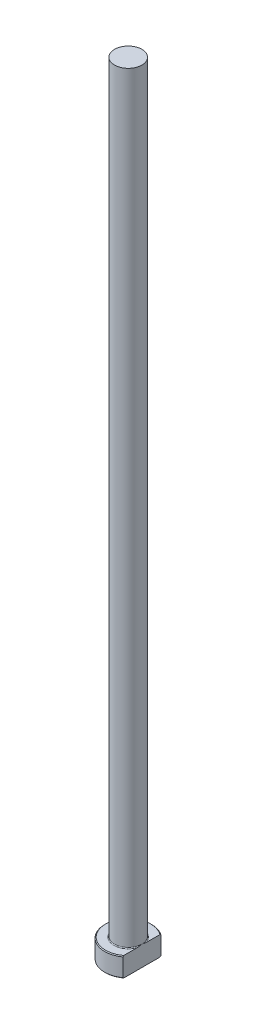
ISO-10303-21;
HEADER;
FILE_DESCRIPTION(('STEP AP214'),'2;1');
FILE_NAME('part.step','',(''),(''),'','','');
FILE_SCHEMA(('AUTOMOTIVE_DESIGN { 1 0 10303 214 1 1 1 1 }'));
ENDSEC;
DATA;
#1=APPLICATION_CONTEXT('core data for automotive mechanical design processes');
#2=APPLICATION_PROTOCOL_DEFINITION('international standard','automotive_design',2000,#1);
#3=PRODUCT_CONTEXT('',#1,'mechanical');
#4=PRODUCT('Part','Part','',(#3));
#5=PRODUCT_RELATED_PRODUCT_CATEGORY('part','',(#4));
#6=PRODUCT_DEFINITION_FORMATION('','',#4);
#7=PRODUCT_DEFINITION_CONTEXT('part definition',#1,'design');
#8=PRODUCT_DEFINITION('design','',#6,#7);
#9=PRODUCT_DEFINITION_SHAPE('','',#8);
#10=(LENGTH_UNIT() NAMED_UNIT(*) SI_UNIT(.MILLI.,.METRE.));
#11=(NAMED_UNIT(*) PLANE_ANGLE_UNIT() SI_UNIT($,.RADIAN.));
#12=(NAMED_UNIT(*) SI_UNIT($,.STERADIAN.) SOLID_ANGLE_UNIT());
#13=UNCERTAINTY_MEASURE_WITH_UNIT(LENGTH_MEASURE(1.E-05),#10,'distance_accuracy_value','');
#14=(GEOMETRIC_REPRESENTATION_CONTEXT(3) GLOBAL_UNCERTAINTY_ASSIGNED_CONTEXT((#13)) GLOBAL_UNIT_ASSIGNED_CONTEXT((#10,
#11,#12)) REPRESENTATION_CONTEXT('',''));
#15=CARTESIAN_POINT('',(0.,0.,0.));
#16=DIRECTION('',(0.,0.,1.));
#17=DIRECTION('',(1.,0.,0.));
#18=AXIS2_PLACEMENT_3D('',#15,#16,#17);
#19=CARTESIAN_POINT('',(0.,0.,0.));
#20=DIRECTION('',(0.,-1.,0.));
#21=DIRECTION('',(0.,0.,-1.));
#22=AXIS2_PLACEMENT_3D('',#19,#20,#21);
#23=PLANE('',#22);
#24=CARTESIAN_POINT('',(0.,0.,0.));
#25=DIRECTION('',(0.,-1.,0.));
#26=DIRECTION('',(0.,0.,-1.));
#27=AXIS2_PLACEMENT_3D('',#24,#25,#26);
#28=CIRCLE('',#27,5.79999999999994);
#29=CARTESIAN_POINT('',(3.49999999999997,0.,4.62493243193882));
#30=VERTEX_POINT('',#29);
#31=CARTESIAN_POINT('',(3.49999999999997,0.,-4.62493243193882));
#32=VERTEX_POINT('',#31);
#33=EDGE_CURVE('E98',#30,#32,#28,.T.);
#34=ORIENTED_EDGE('',*,*,#33,.T.);
#35=DIRECTION('',(0.,0.,1.));
#36=VECTOR('',#35,1.);
#37=CARTESIAN_POINT('',(3.49999999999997,0.,-4.87339717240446));
#38=LINE('',#37,#36);
#39=EDGE_CURVE('E83',#32,#30,#38,.T.);
#40=ORIENTED_EDGE('',*,*,#39,.T.);
#41=EDGE_LOOP('',(#34,#40));
#42=FACE_BOUND('',#41,.T.);
#43=ADVANCED_FACE('F32',(#42),#23,.T.);
#44=CARTESIAN_POINT('',(0.,259.958771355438,0.));
#45=DIRECTION('',(0.,1.,0.));
#46=DIRECTION('',(0.,0.,1.));
#47=AXIS2_PLACEMENT_3D('',#44,#45,#46);
#48=CYLINDRICAL_SURFACE('',#47,5.99999999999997);
#49=CARTESIAN_POINT('',(0.,4.80000000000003,0.));
#50=DIRECTION('',(0.,1.,0.));
#51=DIRECTION('',(0.,0.,1.));
#52=AXIS2_PLACEMENT_3D('',#49,#50,#51);
#53=CIRCLE('',#52,5.99999999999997);
#54=CARTESIAN_POINT('',(3.49999999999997,4.80000000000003,4.87339717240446));
#55=VERTEX_POINT('',#54);
#56=CARTESIAN_POINT('',(3.49999999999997,4.80000000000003,-4.87339717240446));
#57=VERTEX_POINT('',#56);
#58=EDGE_CURVE('E104',#55,#57,#53,.F.);
#59=ORIENTED_EDGE('',*,*,#58,.T.);
#60=DIRECTION('',(0.,-1.,0.));
#61=VECTOR('',#60,1.);
#62=CARTESIAN_POINT('',(3.49999999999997,200.,-4.87339717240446));
#63=LINE('',#62,#61);
#64=CARTESIAN_POINT('',(3.49999999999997,0.200000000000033,-4.87339717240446));
#65=VERTEX_POINT('',#64);
#66=EDGE_CURVE('E183',#57,#65,#63,.T.);
#67=ORIENTED_EDGE('',*,*,#66,.T.);
#68=CARTESIAN_POINT('',(0.,0.200000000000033,0.));
#69=DIRECTION('',(0.,-1.,0.));
#70=DIRECTION('',(0.,0.,-1.));
#71=AXIS2_PLACEMENT_3D('',#68,#69,#70);
#72=CIRCLE('',#71,5.99999999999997);
#73=CARTESIAN_POINT('',(3.49999999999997,0.200000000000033,4.87339717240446));
#74=VERTEX_POINT('',#73);
#75=EDGE_CURVE('E100',#65,#74,#72,.F.);
#76=ORIENTED_EDGE('',*,*,#75,.T.);
#77=DIRECTION('',(0.,-1.,0.));
#78=VECTOR('',#77,1.);
#79=CARTESIAN_POINT('',(3.49999999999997,200.,4.87339717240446));
#80=LINE('',#79,#78);
#81=EDGE_CURVE('E93',#55,#74,#80,.T.);
#82=ORIENTED_EDGE('',*,*,#81,.F.);
#83=EDGE_LOOP('',(#59,#67,#76,#82));
#84=FACE_BOUND('',#83,.T.);
#85=ADVANCED_FACE('F158',(#84),#48,.T.);
#86=CARTESIAN_POINT('',(-5.99999999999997,5.,0.));
#87=DIRECTION('',(0.,1.,0.));
#88=DIRECTION('',(0.,0.,1.));
#89=AXIS2_PLACEMENT_3D('',#86,#87,#88);
#90=PLANE('',#89);
#91=CARTESIAN_POINT('',(0.,5.,0.));
#92=DIRECTION('',(0.,1.,0.));
#93=DIRECTION('',(0.,0.,1.));
#94=AXIS2_PLACEMENT_3D('',#91,#92,#93);
#95=CIRCLE('',#94,5.79999999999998);
#96=CARTESIAN_POINT('',(3.49999999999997,5.,-4.62493243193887));
#97=VERTEX_POINT('',#96);
#98=CARTESIAN_POINT('',(3.49999999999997,5.,4.62493243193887));
#99=VERTEX_POINT('',#98);
#100=EDGE_CURVE('E178',#97,#99,#95,.T.);
#101=ORIENTED_EDGE('',*,*,#100,.T.);
#102=DIRECTION('',(0.,0.,-1.));
#103=VECTOR('',#102,1.);
#104=CARTESIAN_POINT('',(3.49999999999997,5.,0.));
#105=LINE('',#104,#103);
#106=CARTESIAN_POINT('',(3.49999999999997,4.99999999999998,1.19999999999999));
#107=VERTEX_POINT('',#106);
#108=EDGE_CURVE('E57',#99,#107,#105,.T.);
#109=ORIENTED_EDGE('',*,*,#108,.T.);
#110=CARTESIAN_POINT('',(0.,5.,0.));
#111=DIRECTION('',(0.,1.,0.));
#112=DIRECTION('',(0.,0.,1.));
#113=AXIS2_PLACEMENT_3D('',#110,#111,#112);
#114=CIRCLE('',#113,3.69999999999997);
#115=CARTESIAN_POINT('',(3.49999999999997,4.99999999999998,-1.19999999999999));
#116=VERTEX_POINT('',#115);
#117=EDGE_CURVE('E107',#107,#116,#114,.F.);
#118=ORIENTED_EDGE('',*,*,#117,.T.);
#119=EDGE_CURVE('E136',#116,#97,#105,.T.);
#120=ORIENTED_EDGE('',*,*,#119,.T.);
#121=EDGE_LOOP('',(#101,#109,#118,#120));
#122=FACE_BOUND('',#121,.T.);
#123=ADVANCED_FACE('F147',(#122),#90,.T.);
#124=CARTESIAN_POINT('',(0.,5.,0.));
#125=DIRECTION('',(0.,-1.,0.));
#126=DIRECTION('',(0.,0.,-1.));
#127=AXIS2_PLACEMENT_3D('',#124,#125,#126);
#128=CONICAL_SURFACE('',#127,5.79999999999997,0.785398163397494);
#129=ORIENTED_EDGE('',*,*,#58,.F.);
#130=CARTESIAN_POINT('',(3.49999999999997,-0.479658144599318,10.7229048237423));
#131=CARTESIAN_POINT('',(3.49999999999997,-0.304627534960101,10.5387821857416));
#132=CARTESIAN_POINT('',(3.49999999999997,-0.12982047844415,10.3544468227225));
#133=CARTESIAN_POINT('',(3.49999999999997,0.219261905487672,9.98527122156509));
#134=CARTESIAN_POINT('',(3.49999999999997,0.39353722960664,9.80043098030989));
#135=CARTESIAN_POINT('',(3.49999999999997,0.91559488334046,9.24486752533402));
#136=CARTESIAN_POINT('',(3.49999999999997,1.26244829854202,8.87327020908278));
#137=CARTESIAN_POINT('',(3.49999999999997,1.95718621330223,8.12195979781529));
#138=CARTESIAN_POINT('',(3.49999999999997,2.30502483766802,7.74220412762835));
#139=CARTESIAN_POINT('',(3.49999999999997,2.82267860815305,7.16898192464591));
#140=CARTESIAN_POINT('',(3.49999999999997,2.99451670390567,6.97734293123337));
#141=CARTESIAN_POINT('',(3.49999999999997,3.33649221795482,6.59255347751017));
#142=CARTESIAN_POINT('',(3.49999999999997,3.50662964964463,6.39940302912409));
#143=CARTESIAN_POINT('',(3.49999999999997,3.80984794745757,6.05127590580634));
#144=CARTESIAN_POINT('',(3.49999999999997,3.9433293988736,5.89664839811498));
#145=CARTESIAN_POINT('',(3.49999999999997,4.20861192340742,5.58595941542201));
#146=CARTESIAN_POINT('',(3.49999999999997,4.34041301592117,5.42989795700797));
#147=CARTESIAN_POINT('',(3.49999999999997,4.60204886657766,5.11587234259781));
#148=CARTESIAN_POINT('',(3.49999999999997,4.73188156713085,4.9579064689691));
#149=CARTESIAN_POINT('',(3.49999999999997,4.98887681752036,4.63982145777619));
#150=CARTESIAN_POINT('',(3.49999999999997,5.11603946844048,4.47970240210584));
#151=CARTESIAN_POINT('',(3.49999999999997,5.36664013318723,4.15712646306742));
#152=CARTESIAN_POINT('',(3.49999999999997,5.49008567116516,3.99467544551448));
#153=CARTESIAN_POINT('',(3.49999999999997,5.73245687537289,3.6663703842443));
#154=CARTESIAN_POINT('',(3.49999999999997,5.85138169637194,3.50051571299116));
#155=CARTESIAN_POINT('',(3.49999999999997,6.08288587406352,3.16479623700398));
#156=CARTESIAN_POINT('',(3.49999999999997,6.19547497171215,2.99493819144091));
#157=CARTESIAN_POINT('',(3.49999999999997,6.41208556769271,2.6498795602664));
#158=CARTESIAN_POINT('',(3.49999999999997,6.51611116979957,2.47468158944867));
#159=CARTESIAN_POINT('',(3.49999999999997,6.68667355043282,2.16371702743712));
#160=CARTESIAN_POINT('',(3.49999999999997,6.75595020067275,2.02946380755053));
#161=CARTESIAN_POINT('',(3.49999999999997,6.88572771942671,1.75668071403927));
#162=CARTESIAN_POINT('',(3.49999999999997,6.9462264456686,1.61814980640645));
#163=CARTESIAN_POINT('',(3.49999999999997,7.05535730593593,1.33751093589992));
#164=CARTESIAN_POINT('',(3.49999999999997,7.10406788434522,1.1954339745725));
#165=CARTESIAN_POINT('',(3.49999999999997,7.18698872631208,0.907101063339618));
#166=CARTESIAN_POINT('',(3.49999999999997,7.22121012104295,0.760848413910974));
#167=CARTESIAN_POINT('',(3.49999999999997,7.26487302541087,0.507831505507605));
#168=CARTESIAN_POINT('',(3.49999999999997,7.27861043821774,0.401805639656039));
#169=CARTESIAN_POINT('',(3.49999999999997,7.29650595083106,0.188947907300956));
#170=CARTESIAN_POINT('',(3.49999999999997,7.30066582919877,0.0821161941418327));
#171=CARTESIAN_POINT('',(3.49999999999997,7.29916002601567,-0.131492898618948));
#172=CARTESIAN_POINT('',(3.49999999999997,7.29349282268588,-0.238270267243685));
#173=CARTESIAN_POINT('',(3.49999999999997,7.27266406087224,-0.450895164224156));
#174=CARTESIAN_POINT('',(3.49999999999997,7.25750065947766,-0.556742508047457));
#175=CARTESIAN_POINT('',(3.49999999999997,7.21256554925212,-0.79858965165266));
#176=CARTESIAN_POINT('',(3.49999999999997,7.17976248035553,-0.934025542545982));
#177=CARTESIAN_POINT('',(3.49999999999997,7.10180151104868,-1.20127435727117));
#178=CARTESIAN_POINT('',(3.49999999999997,7.05663717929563,-1.33308535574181));
#179=CARTESIAN_POINT('',(3.49999999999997,6.95617548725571,-1.59358719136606));
#180=CARTESIAN_POINT('',(3.49999999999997,6.90082290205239,-1.72225647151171));
#181=CARTESIAN_POINT('',(3.49999999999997,6.81196782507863,-1.91246868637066));
#182=CARTESIAN_POINT('',(3.49999999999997,6.78138093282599,-1.97540288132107));
#183=CARTESIAN_POINT('',(3.49999999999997,6.71848328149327,-2.10040375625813));
#184=CARTESIAN_POINT('',(3.49999999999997,6.68617255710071,-2.16247045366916));
#185=CARTESIAN_POINT('',(3.49999999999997,6.59348343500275,-2.33529342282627));
#186=CARTESIAN_POINT('',(3.49999999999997,6.53139715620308,-2.44513435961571));
#187=CARTESIAN_POINT('',(3.49999999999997,6.40327495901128,-2.66249790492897));
#188=CARTESIAN_POINT('',(3.49999999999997,6.33723828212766,-2.77002006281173));
#189=CARTESIAN_POINT('',(3.49999999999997,6.20193961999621,-2.98310926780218));
#190=CARTESIAN_POINT('',(3.49999999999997,6.13267551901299,-3.08867496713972));
#191=CARTESIAN_POINT('',(3.49999999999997,5.99154722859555,-3.29805772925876));
#192=CARTESIAN_POINT('',(3.49999999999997,5.91968285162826,-3.40187466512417));
#193=CARTESIAN_POINT('',(3.49999999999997,5.70053198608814,-3.71160333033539));
#194=CARTESIAN_POINT('',(3.49999999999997,5.55004115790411,-3.91524708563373));
#195=CARTESIAN_POINT('',(3.49999999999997,5.24323373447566,-4.31793623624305));
#196=CARTESIAN_POINT('',(3.49999999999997,5.08691924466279,-4.5169832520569));
#197=CARTESIAN_POINT('',(3.49999999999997,4.76917008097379,-4.91272714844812));
#198=CARTESIAN_POINT('',(3.49999999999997,4.60771212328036,-5.10940527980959));
#199=CARTESIAN_POINT('',(3.49999999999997,4.28159454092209,-5.50010578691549));
#200=CARTESIAN_POINT('',(3.49999999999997,4.11693466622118,-5.69412795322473));
#201=CARTESIAN_POINT('',(3.49999999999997,3.7854437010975,-6.07977702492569));
#202=CARTESIAN_POINT('',(3.49999999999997,3.61861641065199,-6.27140720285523));
#203=CARTESIAN_POINT('',(3.49999999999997,3.28306967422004,-6.65300504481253));
#204=CARTESIAN_POINT('',(3.49999999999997,3.11435020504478,-6.84297268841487));
#205=CARTESIAN_POINT('',(3.49999999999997,2.66324311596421,-7.3468737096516));
#206=CARTESIAN_POINT('',(3.49999999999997,2.37954008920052,-7.65962881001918));
#207=CARTESIAN_POINT('',(3.49999999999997,1.80910784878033,-8.28261634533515));
#208=CARTESIAN_POINT('',(3.49999999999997,1.52237733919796,-8.59284759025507));
#209=CARTESIAN_POINT('',(3.49999999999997,0.950562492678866,-9.20727688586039));
#210=CARTESIAN_POINT('',(3.49999999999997,0.665505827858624,-9.51150072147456));
#211=CARTESIAN_POINT('',(3.49999999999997,0.0939335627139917,-10.1182972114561));
#212=CARTESIAN_POINT('',(3.49999999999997,-0.192581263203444,-10.4208705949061));
#213=CARTESIAN_POINT('',(3.49999999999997,-0.479658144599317,-10.7229048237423));
#214=B_SPLINE_CURVE_WITH_KNOTS('',3,(#130,#131,#132,#133,#134,#135,#136,#137,#138,#139,#140,
#141,#142,#143,#144,#145,#146,#147,#148,#149,#150,#151,#152,#153,#154,#155,#156,#157,#158,#159,
#160,#161,#162,#163,#164,#165,#166,#167,#168,#169,#170,#171,#172,#173,#174,#175,#176,#177,#178,
#179,#180,#181,#182,#183,#184,#185,#186,#187,#188,#189,#190,#191,#192,#193,#194,#195,#196,#197,
#198,#199,#200,#201,#202,#203,#204,#205,#206,#207,#208,#209,#210,#211,#212,#213),.UNSPECIFIED.,
.F.,.F.,(4,2,2,2,2,2,2,2,2,2,2,2,2,2,2,2,2,2,2,2,2,2,2,2,2,2,2,2,2,2,2,2,2,2,2,2,2,2,2,2,2,4),
(0.,0.762123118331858,1.52425095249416,3.04920520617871,4.59410962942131,5.36629689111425,
6.13847806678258,6.75128402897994,7.36408291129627,7.97748343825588,8.59086070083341,
9.20289910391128,9.81505138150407,10.4262352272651,11.0371244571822,11.4901076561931,
11.94320122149,12.393191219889,12.842834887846,13.1631796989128,13.4834650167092,
13.8037999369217,14.1241970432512,14.5415079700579,14.9590364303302,15.3788985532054,
15.5887982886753,15.7986938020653,16.1771020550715,16.5555831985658,16.9343160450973,
17.3130762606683,18.0725457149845,18.8317432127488,19.5950831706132,20.3584829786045,
21.1206884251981,21.88290322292,23.1496528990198,24.4169687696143,25.6676760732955,
26.9177769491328),.UNSPECIFIED.);
#215=EDGE_CURVE('E135',#55,#99,#214,.T.);
#216=ORIENTED_EDGE('',*,*,#215,.T.);
#217=ORIENTED_EDGE('',*,*,#100,.F.);
#218=EDGE_CURVE('E127',#97,#57,#214,.T.);
#219=ORIENTED_EDGE('',*,*,#218,.T.);
#220=EDGE_LOOP('',(#129,#216,#217,#219));
#221=FACE_BOUND('',#220,.T.);
#222=ADVANCED_FACE('F143',(#221),#128,.T.);
#223=CARTESIAN_POINT('',(0.,0.200000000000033,0.));
#224=DIRECTION('',(0.,1.,0.));
#225=DIRECTION('',(0.,0.,1.));
#226=AXIS2_PLACEMENT_3D('',#223,#224,#225);
#227=CONICAL_SURFACE('',#226,5.99999999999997,0.785398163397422);
#228=ORIENTED_EDGE('',*,*,#75,.F.);
#229=CARTESIAN_POINT('',(3.49999999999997,5.47965814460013,-10.7229048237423));
#230=CARTESIAN_POINT('',(3.49999999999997,5.3046275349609,-10.5387821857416));
#231=CARTESIAN_POINT('',(3.49999999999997,5.12982047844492,-10.3544468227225));
#232=CARTESIAN_POINT('',(3.49999999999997,4.78073809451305,-9.9852712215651));
#233=CARTESIAN_POINT('',(3.49999999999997,4.60646277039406,-9.80043098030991));
#234=CARTESIAN_POINT('',(3.49999999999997,4.08440511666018,-9.24486752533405));
#235=CARTESIAN_POINT('',(3.49999999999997,3.73755170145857,-8.87327020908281));
#236=CARTESIAN_POINT('',(3.49999999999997,3.04281378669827,-8.12195979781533));
#237=CARTESIAN_POINT('',(3.49999999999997,2.69497516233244,-7.74220412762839));
#238=CARTESIAN_POINT('',(3.49999999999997,2.17732139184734,-7.16898192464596));
#239=CARTESIAN_POINT('',(3.49999999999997,2.0054832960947,-6.97734293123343));
#240=CARTESIAN_POINT('',(3.49999999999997,1.66350778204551,-6.59255347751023));
#241=CARTESIAN_POINT('',(3.49999999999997,1.49337035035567,-6.39940302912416));
#242=CARTESIAN_POINT('',(3.49999999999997,1.1901520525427,-6.05127590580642));
#243=CARTESIAN_POINT('',(3.49999999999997,1.05667060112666,-5.89664839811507));
#244=CARTESIAN_POINT('',(3.49999999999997,0.791388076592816,-5.58595941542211));
#245=CARTESIAN_POINT('',(3.49999999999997,0.659586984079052,-5.42989795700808));
#246=CARTESIAN_POINT('',(3.49999999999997,0.397951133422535,-5.11587234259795));
#247=CARTESIAN_POINT('',(3.49999999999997,0.26811843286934,-4.95790646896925));
#248=CARTESIAN_POINT('',(3.49999999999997,0.0111231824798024,-4.63982145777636));
#249=CARTESIAN_POINT('',(3.49999999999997,-0.116039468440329,-4.47970240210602));
#250=CARTESIAN_POINT('',(3.49999999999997,-0.366640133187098,-4.15712646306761));
#251=CARTESIAN_POINT('',(3.49999999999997,-0.490085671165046,-3.99467544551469));
#252=CARTESIAN_POINT('',(3.49999999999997,-0.7324568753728,-3.66637038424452));
#253=CARTESIAN_POINT('',(3.49999999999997,-0.851381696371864,-3.50051571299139));
#254=CARTESIAN_POINT('',(3.49999999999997,-1.08288587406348,-3.16479623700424));
#255=CARTESIAN_POINT('',(3.49999999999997,-1.19547497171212,-2.99493819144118));
#256=CARTESIAN_POINT('',(3.49999999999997,-1.41208556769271,-2.64987956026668));
#257=CARTESIAN_POINT('',(3.49999999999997,-1.51611116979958,-2.47468158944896));
#258=CARTESIAN_POINT('',(3.49999999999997,-1.68667355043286,-2.16371702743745));
#259=CARTESIAN_POINT('',(3.49999999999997,-1.7559502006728,-2.02946380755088));
#260=CARTESIAN_POINT('',(3.49999999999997,-1.88572771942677,-1.75668071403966));
#261=CARTESIAN_POINT('',(3.49999999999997,-1.94622644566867,-1.61814980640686));
#262=CARTESIAN_POINT('',(3.49999999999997,-2.05535730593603,-1.33751093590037));
#263=CARTESIAN_POINT('',(3.49999999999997,-2.10406788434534,-1.19543397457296));
#264=CARTESIAN_POINT('',(3.49999999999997,-2.18698872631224,-0.907101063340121));
#265=CARTESIAN_POINT('',(3.49999999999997,-2.22121012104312,-0.760848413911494));
#266=CARTESIAN_POINT('',(3.49999999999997,-2.26487302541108,-0.507831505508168));
#267=CARTESIAN_POINT('',(3.49999999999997,-2.27861043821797,-0.401805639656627));
#268=CARTESIAN_POINT('',(3.49999999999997,-2.29650595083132,-0.188947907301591));
#269=CARTESIAN_POINT('',(3.49999999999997,-2.30066582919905,-0.0821161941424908));
#270=CARTESIAN_POINT('',(3.49999999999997,-2.299160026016,0.131492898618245));
#271=CARTESIAN_POINT('',(3.49999999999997,-2.29349282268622,0.238270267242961));
#272=CARTESIAN_POINT('',(3.49999999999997,-2.27266406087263,0.450895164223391));
#273=CARTESIAN_POINT('',(3.49999999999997,-2.25750065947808,0.556742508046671));
#274=CARTESIAN_POINT('',(3.49999999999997,-2.2125655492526,0.798589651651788));
#275=CARTESIAN_POINT('',(3.49999999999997,-2.17976248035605,0.934025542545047));
#276=CARTESIAN_POINT('',(3.49999999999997,-2.10180151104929,1.20127435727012));
#277=CARTESIAN_POINT('',(3.49999999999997,-2.05663717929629,1.3330853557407));
#278=CARTESIAN_POINT('',(3.49999999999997,-1.95617548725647,1.59358719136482));
#279=CARTESIAN_POINT('',(3.49999999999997,-1.9008229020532,1.72225647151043));
#280=CARTESIAN_POINT('',(3.49999999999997,-1.81196782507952,1.91246868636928));
#281=CARTESIAN_POINT('',(3.49999999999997,-1.7813809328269,1.97540288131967));
#282=CARTESIAN_POINT('',(3.49999999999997,-1.71848328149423,2.10040375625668));
#283=CARTESIAN_POINT('',(3.49999999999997,-1.6861725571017,2.16247045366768));
#284=CARTESIAN_POINT('',(3.49999999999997,-1.59348343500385,2.33529342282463));
#285=CARTESIAN_POINT('',(3.49999999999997,-1.53139715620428,2.44513435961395));
#286=CARTESIAN_POINT('',(3.49999999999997,-1.40327495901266,2.66249790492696));
#287=CARTESIAN_POINT('',(3.49999999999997,-1.33723828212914,2.7700200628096));
#288=CARTESIAN_POINT('',(3.49999999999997,-1.20193961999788,2.98310926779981));
#289=CARTESIAN_POINT('',(3.49999999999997,-1.13267551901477,3.08867496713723));
#290=CARTESIAN_POINT('',(3.49999999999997,-0.99154722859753,3.29805772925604));
#291=CARTESIAN_POINT('',(3.49999999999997,-0.919682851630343,3.40187466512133));
#292=CARTESIAN_POINT('',(3.49999999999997,-0.700531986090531,3.71160333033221));
#293=CARTESIAN_POINT('',(3.49999999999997,-0.550041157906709,3.91524708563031));
#294=CARTESIAN_POINT('',(3.49999999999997,-0.243233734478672,4.31793623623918));
#295=CARTESIAN_POINT('',(3.49999999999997,-0.0869192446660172,4.5169832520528));
#296=CARTESIAN_POINT('',(3.49999999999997,0.230829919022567,4.91272714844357));
#297=CARTESIAN_POINT('',(3.49999999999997,0.39228787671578,5.10940527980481));
#298=CARTESIAN_POINT('',(3.49999999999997,0.718405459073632,5.50010578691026));
#299=CARTESIAN_POINT('',(3.49999999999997,0.883065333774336,5.69412795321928));
#300=CARTESIAN_POINT('',(3.49999999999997,1.21455629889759,6.07977702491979));
#301=CARTESIAN_POINT('',(3.49999999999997,1.3813835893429,6.2714072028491));
#302=CARTESIAN_POINT('',(3.49999999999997,1.71693032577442,6.65300504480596));
#303=CARTESIAN_POINT('',(3.49999999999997,1.88564979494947,6.84297268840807));
#304=CARTESIAN_POINT('',(3.49999999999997,2.33675688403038,7.34687370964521));
#305=CARTESIAN_POINT('',(3.49999999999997,2.62045991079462,7.6596288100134));
#306=CARTESIAN_POINT('',(3.49999999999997,3.19089215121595,8.28261634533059));
#307=CARTESIAN_POINT('',(3.49999999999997,3.47762266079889,8.59284759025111));
#308=CARTESIAN_POINT('',(3.49999999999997,4.04943750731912,9.20727688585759));
#309=CARTESIAN_POINT('',(3.49999999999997,4.33449417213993,9.51150072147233));
#310=CARTESIAN_POINT('',(3.49999999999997,4.90606643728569,10.118297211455));
#311=CARTESIAN_POINT('',(3.49999999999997,5.19258126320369,10.4208705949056));
#312=CARTESIAN_POINT('',(3.49999999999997,5.47965814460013,10.7229048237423));
#313=B_SPLINE_CURVE_WITH_KNOTS('',3,(#229,#230,#231,#232,#233,#234,#235,#236,#237,#238,#239,
#240,#241,#242,#243,#244,#245,#246,#247,#248,#249,#250,#251,#252,#253,#254,#255,#256,#257,#258,
#259,#260,#261,#262,#263,#264,#265,#266,#267,#268,#269,#270,#271,#272,#273,#274,#275,#276,#277,
#278,#279,#280,#281,#282,#283,#284,#285,#286,#287,#288,#289,#290,#291,#292,#293,#294,#295,#296,
#297,#298,#299,#300,#301,#302,#303,#304,#305,#306,#307,#308,#309,#310,#311,#312),.UNSPECIFIED.,
.F.,.F.,(4,2,2,2,2,2,2,2,2,2,2,2,2,2,2,2,2,2,2,2,2,2,2,2,2,2,2,2,2,2,2,2,2,2,2,2,2,2,2,2,2,4),
(0.,0.762123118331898,1.52425095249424,3.04920520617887,4.59410962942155,5.36629689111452,
6.13847806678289,6.75128402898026,7.36408291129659,7.9774834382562,8.59086070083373,
9.20289910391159,9.81505138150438,10.4262352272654,11.0371244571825,11.4901076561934,
11.9432012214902,12.3931912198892,12.8428348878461,13.1631796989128,13.4834650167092,
13.8037999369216,14.1241970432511,14.5415079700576,14.9590364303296,15.3788985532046,
15.5887982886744,15.7986938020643,16.1771020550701,16.5555831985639,16.9343160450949,
17.3130762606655,18.0725457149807,18.8317432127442,19.5950831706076,20.3584829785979,
21.1206884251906,21.8829032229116,23.1496528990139,24.4169687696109,25.6676760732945,
26.9177769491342),.UNSPECIFIED.);
#314=EDGE_CURVE('E86',#65,#32,#313,.T.);
#315=ORIENTED_EDGE('',*,*,#314,.T.);
#316=ORIENTED_EDGE('',*,*,#33,.F.);
#317=EDGE_CURVE('E89',#30,#74,#313,.T.);
#318=ORIENTED_EDGE('',*,*,#317,.T.);
#319=EDGE_LOOP('',(#228,#315,#316,#318));
#320=FACE_BOUND('',#319,.T.);
#321=ADVANCED_FACE('F97',(#320),#227,.T.);
#322=CARTESIAN_POINT('',(0.,5.19999999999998,0.));
#323=DIRECTION('',(0.,1.,0.));
#324=DIRECTION('',(0.,0.,1.));
#325=AXIS2_PLACEMENT_3D('',#322,#323,#324);
#326=TOROIDAL_SURFACE('',#325,3.69999999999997,0.2);
#327=CARTESIAN_POINT('',(3.49999999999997,5.19999999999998,0.));
#328=CARTESIAN_POINT('',(3.49999999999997,5.20000050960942,9.98094828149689E-11));
#329=CARTESIAN_POINT('',(3.49999999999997,5.20000101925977,-2.13486746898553E-07));
#330=CARTESIAN_POINT('',(3.49999999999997,5.20000196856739,-7.957591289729E-07));
#331=CARTESIAN_POINT('',(3.49999999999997,5.20000239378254,-1.17925839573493E-06));
#332=CARTESIAN_POINT('',(3.49999999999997,5.20000328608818,-2.10014972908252E-06));
#333=CARTESIAN_POINT('',(3.49999999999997,5.20000373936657,-2.65249908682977E-06));
#334=CARTESIAN_POINT('',(3.49999999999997,5.20000454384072,-3.79112889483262E-06));
#335=CARTESIAN_POINT('',(3.49999999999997,5.20000489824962,-4.37533521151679E-06));
#336=CARTESIAN_POINT('',(3.49999999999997,5.20000623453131,-6.66270059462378E-06));
#337=CARTESIAN_POINT('',(3.49999999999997,5.20000714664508,-8.40961025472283E-06));
#338=CARTESIAN_POINT('',(3.49999999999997,5.20000862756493,-1.18496824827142E-05));
#339=CARTESIAN_POINT('',(3.49999999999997,5.20000922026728,-1.35329548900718E-05));
#340=CARTESIAN_POINT('',(3.49999999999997,5.20001174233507,-2.07268950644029E-05));
#341=CARTESIAN_POINT('',(3.49999999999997,5.20001365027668,-2.62477536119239E-05));
#342=CARTESIAN_POINT('',(3.49999999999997,5.20001642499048,-3.66274572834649E-05));
#343=CARTESIAN_POINT('',(3.49999999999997,5.20001740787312,-4.14549355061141E-05));
#344=CARTESIAN_POINT('',(3.49999999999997,5.20002462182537,-7.75352102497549E-05));
#345=CARTESIAN_POINT('',(3.49999999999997,5.20003014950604,-0.000108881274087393));
#346=CARTESIAN_POINT('',(3.49999999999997,5.20005434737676,-0.000233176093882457));
#347=CARTESIAN_POINT('',(3.49999999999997,5.20007737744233,-0.000325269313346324));
#348=CARTESIAN_POINT('',(3.49999999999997,5.20016742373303,-0.000691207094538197));
#349=CARTESIAN_POINT('',(3.49999999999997,5.20023166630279,-0.000965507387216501));
#350=CARTESIAN_POINT('',(3.49999999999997,5.20048971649,-0.0020594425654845));
#351=CARTESIAN_POINT('',(3.49999999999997,5.20068705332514,-0.00287847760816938));
#352=CARTESIAN_POINT('',(3.49999999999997,5.20150941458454,-0.00630050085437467));
#353=CARTESIAN_POINT('',(3.49999999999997,5.20212997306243,-0.00890424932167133));
#354=CARTESIAN_POINT('',(3.49999999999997,5.20703918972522,-0.0294912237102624));
#355=CARTESIAN_POINT('',(3.49999999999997,5.21134300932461,-0.0474719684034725));
#356=CARTESIAN_POINT('',(3.49999999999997,5.21975360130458,-0.0827191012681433));
#357=CARTESIAN_POINT('',(3.49999999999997,5.22386136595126,-0.0999852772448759));
#358=CARTESIAN_POINT('',(3.49999999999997,5.2372401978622,-0.156405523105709));
#359=CARTESIAN_POINT('',(3.49999999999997,5.24645854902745,-0.195572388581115));
#360=CARTESIAN_POINT('',(3.49999999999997,5.26203234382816,-0.262828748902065));
#361=CARTESIAN_POINT('',(3.49999999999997,5.26845671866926,-0.290902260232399));
#362=CARTESIAN_POINT('',(3.49999999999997,5.28094671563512,-0.346379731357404));
#363=CARTESIAN_POINT('',(3.49999999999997,5.28701730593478,-0.373782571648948));
#364=CARTESIAN_POINT('',(3.49999999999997,5.30077691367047,-0.437211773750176));
#365=CARTESIAN_POINT('',(3.49999999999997,5.3083789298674,-0.473257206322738));
#366=CARTESIAN_POINT('',(3.49999999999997,5.32309409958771,-0.545736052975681));
#367=CARTESIAN_POINT('',(3.49999999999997,5.33020304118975,-0.582170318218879));
#368=CARTESIAN_POINT('',(3.49999999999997,5.35161649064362,-0.697757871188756));
#369=CARTESIAN_POINT('',(3.49999999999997,5.36463967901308,-0.777158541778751));
#370=CARTESIAN_POINT('',(3.49999999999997,5.3843837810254,-0.92756184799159));
#371=CARTESIAN_POINT('',(3.49999999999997,5.39165512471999,-0.998486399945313));
#372=CARTESIAN_POINT('',(3.49999999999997,5.3979989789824,-1.10437287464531));
#373=CARTESIAN_POINT('',(3.49999999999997,5.39936233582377,-1.13919451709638));
#374=CARTESIAN_POINT('',(3.49999999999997,5.40028946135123,-1.20885098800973));
#375=CARTESIAN_POINT('',(3.49999999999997,5.39985418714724,-1.24368579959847));
#376=CARTESIAN_POINT('',(3.49999999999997,5.39686573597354,-1.30963279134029));
#377=CARTESIAN_POINT('',(3.49999999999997,5.39453835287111,-1.34075403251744));
#378=CARTESIAN_POINT('',(3.49999999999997,5.38750048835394,-1.40298456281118));
#379=CARTESIAN_POINT('',(3.49999999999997,5.38277118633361,-1.43409178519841));
#380=CARTESIAN_POINT('',(3.49999999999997,5.37000596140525,-1.49609278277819));
#381=CARTESIAN_POINT('',(3.49999999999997,5.36193044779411,-1.52697933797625));
#382=CARTESIAN_POINT('',(3.49999999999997,5.34614337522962,-1.57192957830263));
#383=CARTESIAN_POINT('',(3.49999999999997,5.3402919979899,-1.5866404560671));
#384=CARTESIAN_POINT('',(3.49999999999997,5.32701491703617,-1.6153215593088));
#385=CARTESIAN_POINT('',(3.49999999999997,5.31959341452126,-1.6292936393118));
#386=CARTESIAN_POINT('',(3.49999999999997,5.30547056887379,-1.65150372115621));
#387=CARTESIAN_POINT('',(3.49999999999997,5.29934759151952,-1.6601058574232));
#388=CARTESIAN_POINT('',(3.49999999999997,5.28595656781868,-1.67637400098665));
#389=CARTESIAN_POINT('',(3.49999999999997,5.27869146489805,-1.68404232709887));
#390=CARTESIAN_POINT('',(3.49999999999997,5.26587375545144,-1.69518467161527));
#391=CARTESIAN_POINT('',(3.49999999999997,5.26073958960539,-1.69913647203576));
#392=CARTESIAN_POINT('',(3.49999999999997,5.24994100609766,-1.70624293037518));
#393=CARTESIAN_POINT('',(3.49999999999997,5.24427723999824,-1.70939855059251));
#394=CARTESIAN_POINT('',(3.49999999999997,5.23351378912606,-1.71418736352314));
#395=CARTESIAN_POINT('',(3.49999999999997,5.22849079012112,-1.71599090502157));
#396=CARTESIAN_POINT('',(3.49999999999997,5.21821361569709,-1.71873268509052));
#397=CARTESIAN_POINT('',(3.49999999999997,5.21295968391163,-1.71967181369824));
#398=CARTESIAN_POINT('',(3.49999999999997,5.20234462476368,-1.72059432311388));
#399=CARTESIAN_POINT('',(3.49999999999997,5.19698314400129,-1.72057373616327));
#400=CARTESIAN_POINT('',(3.49999999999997,5.18635093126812,-1.71956893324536));
#401=CARTESIAN_POINT('',(3.49999999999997,5.18108024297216,-1.71858426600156));
#402=CARTESIAN_POINT('',(3.49999999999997,5.17106869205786,-1.71582968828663));
#403=CARTESIAN_POINT('',(3.49999999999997,5.16631466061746,-1.71410641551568));
#404=CARTESIAN_POINT('',(3.49999999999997,5.15709718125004,-1.71001459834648));
#405=CARTESIAN_POINT('',(3.49999999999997,5.15263381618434,-1.70764587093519));
#406=CARTESIAN_POINT('',(3.49999999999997,5.14110717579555,-1.70060771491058));
#407=CARTESIAN_POINT('',(3.49999999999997,5.13433222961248,-1.69546710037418));
#408=CARTESIAN_POINT('',(3.49999999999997,5.12164557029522,-1.68420869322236));
#409=CARTESIAN_POINT('',(3.49999999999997,5.11573697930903,-1.67808752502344));
#410=CARTESIAN_POINT('',(3.49999999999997,5.10028952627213,-1.66008531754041));
#411=CARTESIAN_POINT('',(3.49999999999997,5.09159238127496,-1.64748936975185));
#412=CARTESIAN_POINT('',(3.49999999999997,5.07604019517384,-1.62125022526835));
#413=CARTESIAN_POINT('',(3.49999999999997,5.06918749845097,-1.60760572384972));
#414=CARTESIAN_POINT('',(3.49999999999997,5.05635908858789,-1.57851190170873));
#415=CARTESIAN_POINT('',(3.49999999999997,5.05050870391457,-1.56300807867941));
#416=CARTESIAN_POINT('',(3.49999999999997,5.04009412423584,-1.53156759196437));
#417=CARTESIAN_POINT('',(3.49999999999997,5.03553147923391,-1.51563043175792));
#418=CARTESIAN_POINT('',(3.49999999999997,5.02331191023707,-1.46712048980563));
#419=CARTESIAN_POINT('',(3.49999999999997,5.01724153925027,-1.4341495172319));
#420=CARTESIAN_POINT('',(3.49999999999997,5.00883071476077,-1.37348993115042));
#421=CARTESIAN_POINT('',(3.49999999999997,5.00603148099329,-1.34585663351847));
#422=CARTESIAN_POINT('',(3.49999999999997,5.00204762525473,-1.29046925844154));
#423=CARTESIAN_POINT('',(3.49999999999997,5.00086336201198,-1.26271515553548));
#424=CARTESIAN_POINT('',(3.49999999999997,4.99925913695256,-1.17922229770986));
#425=CARTESIAN_POINT('',(3.49999999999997,5.00080993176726,-1.1234488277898));
#426=CARTESIAN_POINT('',(3.49999999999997,5.00738569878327,-1.01528124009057));
#427=CARTESIAN_POINT('',(3.49999999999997,5.01221131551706,-0.962872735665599));
#428=CARTESIAN_POINT('',(3.49999999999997,5.02425367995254,-0.858750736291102));
#429=CARTESIAN_POINT('',(3.49999999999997,5.03145152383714,-0.807035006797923));
#430=CARTESIAN_POINT('',(3.49999999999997,5.04786442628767,-0.702500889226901));
#431=CARTESIAN_POINT('',(3.49999999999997,5.05712869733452,-0.649690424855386));
#432=CARTESIAN_POINT('',(3.49999999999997,5.07730630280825,-0.542969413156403));
#433=CARTESIAN_POINT('',(3.49999999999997,5.08825618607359,-0.489065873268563));
#434=CARTESIAN_POINT('',(3.49999999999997,5.10770336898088,-0.397738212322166));
#435=CARTESIAN_POINT('',(3.49999999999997,5.11594150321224,-0.360258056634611));
#436=CARTESIAN_POINT('',(3.49999999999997,5.1326812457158,-0.285797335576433));
#437=CARTESIAN_POINT('',(3.49999999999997,5.14117887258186,-0.248815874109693));
#438=CARTESIAN_POINT('',(3.49999999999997,5.15740628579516,-0.179140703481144));
#439=CARTESIAN_POINT('',(3.49999999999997,5.16511243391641,-0.146441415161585));
#440=CARTESIAN_POINT('',(3.49999999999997,5.18096853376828,-0.0796648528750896));
#441=CARTESIAN_POINT('',(3.49999999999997,5.18912333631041,-0.045588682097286));
#442=CARTESIAN_POINT('',(3.49999999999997,5.19787118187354,-0.00889903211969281));
#443=CARTESIAN_POINT('',(3.49999999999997,5.19849305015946,-0.00629009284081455));
#444=CARTESIAN_POINT('',(3.49999999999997,5.19931571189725,-0.00286690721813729));
#445=CARTESIAN_POINT('',(3.49999999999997,5.19951207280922,-0.0020519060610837));
#446=CARTESIAN_POINT('',(3.49999999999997,5.19976893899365,-0.0009629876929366));
#447=CARTESIAN_POINT('',(3.49999999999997,5.19983295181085,-0.00068966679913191));
#448=CARTESIAN_POINT('',(3.49999999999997,5.19992272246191,-0.000324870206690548));
#449=CARTESIAN_POINT('',(3.49999999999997,5.19994571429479,-0.000232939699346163));
#450=CARTESIAN_POINT('',(3.49999999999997,5.19996987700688,-0.000108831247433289));
#451=CARTESIAN_POINT('',(3.49999999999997,5.19997540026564,-7.75074375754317E-05));
#452=CARTESIAN_POINT('',(3.49999999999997,5.19998260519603,-4.1449950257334E-05));
#453=CARTESIAN_POINT('',(3.49999999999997,5.19998358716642,-3.66236562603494E-05));
#454=CARTESIAN_POINT('',(3.49999999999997,5.19998635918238,-2.62464271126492E-05));
#455=CARTESIAN_POINT('',(3.49999999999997,5.19998826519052,-2.07267962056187E-05));
#456=CARTESIAN_POINT('',(3.49999999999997,5.19999078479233,-1.353414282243E-05));
#457=CARTESIAN_POINT('',(3.49999999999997,5.19999137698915,-1.18509583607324E-05));
#458=CARTESIAN_POINT('',(3.49999999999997,5.19999285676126,-8.4109834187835E-06));
#459=CARTESIAN_POINT('',(3.49999999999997,5.19999376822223,-6.66407126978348E-06));
#460=CARTESIAN_POINT('',(3.49999999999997,5.19999510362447,-4.37661194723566E-06));
#461=CARTESIAN_POINT('',(3.49999999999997,5.19999545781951,-3.79235333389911E-06));
#462=CARTESIAN_POINT('',(3.49999999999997,5.19999626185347,-2.65358032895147E-06));
#463=CARTESIAN_POINT('',(3.49999999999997,5.19999671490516,-2.10113839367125E-06));
#464=CARTESIAN_POINT('',(3.49999999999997,5.1999976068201,-1.18003190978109E-06));
#465=CARTESIAN_POINT('',(3.49999999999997,5.19999803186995,-7.96418762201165E-07));
#466=CARTESIAN_POINT('',(3.49999999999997,5.19999898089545,-2.13855187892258E-07));
#467=CARTESIAN_POINT('',(3.49999999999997,5.19999949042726,-9.98022935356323E-11));
#468=CARTESIAN_POINT('',(3.49999999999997,5.19999999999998,0.));
#469=B_SPLINE_CURVE_WITH_KNOTS('',3,(#327,#328,#329,#330,#331,#332,#333,#334,#335,#336,#337,
#338,#339,#340,#341,#342,#343,#344,#345,#346,#347,#348,#349,#350,#351,#352,#353,#354,#355,#356,
#357,#358,#359,#360,#361,#362,#363,#364,#365,#366,#367,#368,#369,#370,#371,#372,#373,#374,#375,
#376,#377,#378,#379,#380,#381,#382,#383,#384,#385,#386,#387,#388,#389,#390,#391,#392,#393,#394,
#395,#396,#397,#398,#399,#400,#401,#402,#403,#404,#405,#406,#407,#408,#409,#410,#411,#412,#413,
#414,#415,#416,#417,#418,#419,#420,#421,#422,#423,#424,#425,#426,#427,#428,#429,#430,#431,#432,
#433,#434,#435,#436,#437,#438,#439,#440,#441,#442,#443,#444,#445,#446,#447,#448,#449,#450,#451,
#452,#453,#454,#455,#456,#457,#458,#459,#460,#461,#462,#463,#464,#465,#466,#467,#468),
.UNSPECIFIED.,.T.,.F.,(4,2,2,2,2,2,2,2,2,2,2,2,2,2,2,2,2,2,2,2,2,2,2,2,2,2,2,2,2,2,2,2,2,2,2,2,
2,2,2,2,2,2,2,2,2,2,2,2,2,2,2,2,2,2,2,2,2,2,2,2,2,2,2,2,2,2,2,2,2,2,4),(0.,1.54778905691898E-06,
3.27068856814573E-06,5.40032147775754E-06,7.44938901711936E-06,1.3341290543E-05,
1.86900588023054E-05,3.61865044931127E-05,5.09488028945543E-05,0.000146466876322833,
0.000431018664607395,0.0012764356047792,0.00380354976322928,0.0118339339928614,
0.0672984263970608,0.120543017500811,0.24125328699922,0.327650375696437,0.411851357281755,
0.52236238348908,0.633723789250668,0.875007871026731,1.08869711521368,1.19320699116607,
1.29766126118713,1.39121331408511,1.4855099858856,1.58095571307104,1.62839133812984,
1.67570160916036,1.70731126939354,1.73884076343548,1.75822424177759,1.77758417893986,
1.79352969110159,1.80945876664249,1.82545370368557,1.84145613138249,1.8565700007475,
1.8716881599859,1.89705349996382,1.92250811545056,1.96816999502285,2.01388964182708,
2.06352392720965,2.11321770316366,2.21356505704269,2.29684564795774,2.3801447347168,
2.54733140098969,2.70515844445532,2.86175703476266,3.02258329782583,3.18758220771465,
3.30270498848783,3.41653913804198,3.51732480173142,3.62243689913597,3.63048332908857,
3.63299799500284,3.63384039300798,3.63412444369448,3.6342198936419,3.63423465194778,
3.63425214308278,3.63425749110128,3.63426338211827,3.63426543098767,3.63426756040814,
3.63426928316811,3.63427083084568),.UNSPECIFIED.);
#470=CARTESIAN_POINT('',(3.49999999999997,5.19999999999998,0.));
#471=VERTEX_POINT('',#470);
#472=EDGE_CURVE('E11',#116,#471,#469,.T.);
#473=ORIENTED_EDGE('',*,*,#472,.F.);
#474=ORIENTED_EDGE('',*,*,#117,.F.);
#475=CARTESIAN_POINT('',(3.49999999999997,5.19999999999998,0.));
#476=CARTESIAN_POINT('',(3.49999999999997,5.19999949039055,-9.98094430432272E-11));
#477=CARTESIAN_POINT('',(3.49999999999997,5.1999989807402,2.1348674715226E-07));
#478=CARTESIAN_POINT('',(3.49999999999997,5.19999803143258,7.95759129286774E-07));
#479=CARTESIAN_POINT('',(3.49999999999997,5.19999760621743,1.17925839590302E-06));
#480=CARTESIAN_POINT('',(3.49999999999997,5.19999671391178,2.10014972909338E-06));
#481=CARTESIAN_POINT('',(3.49999999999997,5.1999962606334,2.65249908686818E-06));
#482=CARTESIAN_POINT('',(3.49999999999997,5.19999545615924,3.79112889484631E-06));
#483=CARTESIAN_POINT('',(3.49999999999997,5.19999510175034,4.37533521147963E-06));
#484=CARTESIAN_POINT('',(3.49999999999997,5.19999376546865,6.66270059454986E-06));
#485=CARTESIAN_POINT('',(3.49999999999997,5.19999285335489,8.40961025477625E-06));
#486=CARTESIAN_POINT('',(3.49999999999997,5.19999137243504,1.18496824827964E-05));
#487=CARTESIAN_POINT('',(3.49999999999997,5.19999077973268,1.35329548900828E-05));
#488=CARTESIAN_POINT('',(3.49999999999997,5.19998825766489,2.07268950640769E-05));
#489=CARTESIAN_POINT('',(3.49999999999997,5.19998634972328,2.62477536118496E-05));
#490=CARTESIAN_POINT('',(3.49999999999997,5.19998357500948,3.66274572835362E-05));
#491=CARTESIAN_POINT('',(3.49999999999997,5.19998259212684,4.14549355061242E-05));
#492=CARTESIAN_POINT('',(3.49999999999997,5.1999753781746,7.75352102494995E-05));
#493=CARTESIAN_POINT('',(3.49999999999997,5.19996985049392,0.000108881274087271));
#494=CARTESIAN_POINT('',(3.49999999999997,5.1999456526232,0.000233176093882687));
#495=CARTESIAN_POINT('',(3.49999999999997,5.19992262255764,0.000325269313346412));
#496=CARTESIAN_POINT('',(3.49999999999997,5.19983257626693,0.000691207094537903));
#497=CARTESIAN_POINT('',(3.49999999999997,5.19976833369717,0.000965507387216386));
#498=CARTESIAN_POINT('',(3.49999999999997,5.19951028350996,0.00205944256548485));
#499=CARTESIAN_POINT('',(3.49999999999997,5.19931294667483,0.00287847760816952));
#500=CARTESIAN_POINT('',(3.49999999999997,5.19849058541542,0.00630050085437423));
#501=CARTESIAN_POINT('',(3.49999999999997,5.19787002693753,0.00890424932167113));
#502=CARTESIAN_POINT('',(3.49999999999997,5.19296081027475,0.0294912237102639));
#503=CARTESIAN_POINT('',(3.49999999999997,5.18865699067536,0.0474719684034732));
#504=CARTESIAN_POINT('',(3.49999999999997,5.18024639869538,0.0827191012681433));
#505=CARTESIAN_POINT('',(3.49999999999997,5.1761386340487,0.0999852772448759));
#506=CARTESIAN_POINT('',(3.49999999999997,5.16275980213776,0.15640552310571));
#507=CARTESIAN_POINT('',(3.49999999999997,5.15354145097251,0.195572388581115));
#508=CARTESIAN_POINT('',(3.49999999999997,5.1379676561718,0.262828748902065));
#509=CARTESIAN_POINT('',(3.49999999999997,5.13154328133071,0.290902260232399));
#510=CARTESIAN_POINT('',(3.49999999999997,5.11905328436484,0.346379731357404));
#511=CARTESIAN_POINT('',(3.49999999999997,5.11298269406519,0.373782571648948));
#512=CARTESIAN_POINT('',(3.49999999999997,5.09922308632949,0.437211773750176));
#513=CARTESIAN_POINT('',(3.49999999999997,5.09162107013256,0.473257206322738));
#514=CARTESIAN_POINT('',(3.49999999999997,5.07690590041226,0.545736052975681));
#515=CARTESIAN_POINT('',(3.49999999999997,5.06979695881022,0.582170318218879));
#516=CARTESIAN_POINT('',(3.49999999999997,5.04838350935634,0.697757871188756));
#517=CARTESIAN_POINT('',(3.49999999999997,5.03536032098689,0.777158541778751));
#518=CARTESIAN_POINT('',(3.49999999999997,5.01561621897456,0.92756184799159));
#519=CARTESIAN_POINT('',(3.49999999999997,5.00834487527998,0.998486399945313));
#520=CARTESIAN_POINT('',(3.49999999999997,5.00200102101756,1.10437287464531));
#521=CARTESIAN_POINT('',(3.49999999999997,5.00063766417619,1.13919451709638));
#522=CARTESIAN_POINT('',(3.49999999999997,4.99971053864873,1.20885098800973));
#523=CARTESIAN_POINT('',(3.49999999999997,5.00014581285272,1.24368579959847));
#524=CARTESIAN_POINT('',(3.49999999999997,5.00313426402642,1.30963279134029));
#525=CARTESIAN_POINT('',(3.49999999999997,5.00546164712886,1.34075403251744));
#526=CARTESIAN_POINT('',(3.49999999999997,5.01249951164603,1.40298456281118));
#527=CARTESIAN_POINT('',(3.49999999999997,5.01722881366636,1.43409178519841));
#528=CARTESIAN_POINT('',(3.49999999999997,5.02999403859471,1.49609278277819));
#529=CARTESIAN_POINT('',(3.49999999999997,5.03806955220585,1.52697933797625));
#530=CARTESIAN_POINT('',(3.49999999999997,5.05385662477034,1.57192957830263));
#531=CARTESIAN_POINT('',(3.49999999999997,5.05970800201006,1.5866404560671));
#532=CARTESIAN_POINT('',(3.49999999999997,5.0729850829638,1.6153215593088));
#533=CARTESIAN_POINT('',(3.49999999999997,5.0804065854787,1.6292936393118));
#534=CARTESIAN_POINT('',(3.49999999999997,5.09452943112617,1.65150372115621));
#535=CARTESIAN_POINT('',(3.49999999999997,5.10065240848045,1.6601058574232));
#536=CARTESIAN_POINT('',(3.49999999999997,5.11404343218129,1.67637400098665));
#537=CARTESIAN_POINT('',(3.49999999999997,5.12130853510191,1.68404232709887));
#538=CARTESIAN_POINT('',(3.49999999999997,5.13412624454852,1.69518467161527));
#539=CARTESIAN_POINT('',(3.49999999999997,5.13926041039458,1.69913647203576));
#540=CARTESIAN_POINT('',(3.49999999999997,5.1500589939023,1.70624293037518));
#541=CARTESIAN_POINT('',(3.49999999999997,5.15572276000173,1.70939855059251));
#542=CARTESIAN_POINT('',(3.49999999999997,5.1664862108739,1.71418736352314));
#543=CARTESIAN_POINT('',(3.49999999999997,5.17150920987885,1.71599090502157));
#544=CARTESIAN_POINT('',(3.49999999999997,5.18178638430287,1.71873268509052));
#545=CARTESIAN_POINT('',(3.49999999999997,5.18704031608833,1.71967181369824));
#546=CARTESIAN_POINT('',(3.49999999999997,5.19765537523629,1.72059432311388));
#547=CARTESIAN_POINT('',(3.49999999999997,5.20301685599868,1.72057373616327));
#548=CARTESIAN_POINT('',(3.49999999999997,5.21364906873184,1.71956893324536));
#549=CARTESIAN_POINT('',(3.49999999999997,5.21891975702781,1.71858426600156));
#550=CARTESIAN_POINT('',(3.49999999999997,5.22893130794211,1.71582968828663));
#551=CARTESIAN_POINT('',(3.49999999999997,5.23368533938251,1.71410641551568));
#552=CARTESIAN_POINT('',(3.49999999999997,5.24290281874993,1.71001459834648));
#553=CARTESIAN_POINT('',(3.49999999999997,5.24736618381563,1.70764587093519));
#554=CARTESIAN_POINT('',(3.49999999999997,5.25889282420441,1.70060771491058));
#555=CARTESIAN_POINT('',(3.49999999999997,5.26566777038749,1.69546710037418));
#556=CARTESIAN_POINT('',(3.49999999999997,5.27835442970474,1.68420869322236));
#557=CARTESIAN_POINT('',(3.49999999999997,5.28426302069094,1.67808752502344));
#558=CARTESIAN_POINT('',(3.49999999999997,5.29971047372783,1.66008531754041));
#559=CARTESIAN_POINT('',(3.49999999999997,5.30840761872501,1.64748936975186));
#560=CARTESIAN_POINT('',(3.49999999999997,5.32395980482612,1.62125022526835));
#561=CARTESIAN_POINT('',(3.49999999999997,5.33081250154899,1.60760572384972));
#562=CARTESIAN_POINT('',(3.49999999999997,5.34364091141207,1.57851190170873));
#563=CARTESIAN_POINT('',(3.49999999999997,5.34949129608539,1.56300807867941));
#564=CARTESIAN_POINT('',(3.49999999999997,5.35990587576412,1.53156759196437));
#565=CARTESIAN_POINT('',(3.49999999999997,5.36446852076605,1.51563043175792));
#566=CARTESIAN_POINT('',(3.49999999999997,5.37668808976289,1.46712048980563));
#567=CARTESIAN_POINT('',(3.49999999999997,5.3827584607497,1.4341495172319));
#568=CARTESIAN_POINT('',(3.49999999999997,5.3911692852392,1.37348993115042));
#569=CARTESIAN_POINT('',(3.49999999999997,5.39396851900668,1.34585663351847));
#570=CARTESIAN_POINT('',(3.49999999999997,5.39795237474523,1.29046925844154));
#571=CARTESIAN_POINT('',(3.49999999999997,5.39913663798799,1.26271515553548));
#572=CARTESIAN_POINT('',(3.49999999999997,5.40074086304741,1.17922229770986));
#573=CARTESIAN_POINT('',(3.49999999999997,5.3991900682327,1.1234488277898));
#574=CARTESIAN_POINT('',(3.49999999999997,5.39261430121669,1.01528124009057));
#575=CARTESIAN_POINT('',(3.49999999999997,5.3877886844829,0.9628727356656));
#576=CARTESIAN_POINT('',(3.49999999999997,5.37574632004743,0.858750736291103));
#577=CARTESIAN_POINT('',(3.49999999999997,5.36854847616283,0.807035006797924));
#578=CARTESIAN_POINT('',(3.49999999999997,5.3521355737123,0.702500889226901));
#579=CARTESIAN_POINT('',(3.49999999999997,5.34287130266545,0.649690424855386));
#580=CARTESIAN_POINT('',(3.49999999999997,5.32269369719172,0.542969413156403));
#581=CARTESIAN_POINT('',(3.49999999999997,5.31174381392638,0.489065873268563));
#582=CARTESIAN_POINT('',(3.49999999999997,5.29229663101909,0.397738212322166));
#583=CARTESIAN_POINT('',(3.49999999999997,5.28405849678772,0.360258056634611));
#584=CARTESIAN_POINT('',(3.49999999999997,5.26731875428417,0.285797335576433));
#585=CARTESIAN_POINT('',(3.49999999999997,5.2588211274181,0.248815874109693));
#586=CARTESIAN_POINT('',(3.49999999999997,5.24259371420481,0.179140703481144));
#587=CARTESIAN_POINT('',(3.49999999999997,5.23488756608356,0.146441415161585));
#588=CARTESIAN_POINT('',(3.49999999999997,5.21903146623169,0.0796648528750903));
#589=CARTESIAN_POINT('',(3.49999999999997,5.21087666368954,0.0455886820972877));
#590=CARTESIAN_POINT('',(3.49999999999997,5.20212881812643,0.00889903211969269));
#591=CARTESIAN_POINT('',(3.49999999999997,5.20150694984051,0.00629009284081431));
#592=CARTESIAN_POINT('',(3.49999999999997,5.20068428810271,0.00286690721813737));
#593=CARTESIAN_POINT('',(3.49999999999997,5.20048792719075,0.00205190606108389));
#594=CARTESIAN_POINT('',(3.49999999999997,5.20023106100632,0.000962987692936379));
#595=CARTESIAN_POINT('',(3.49999999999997,5.20016704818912,0.000689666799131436));
#596=CARTESIAN_POINT('',(3.49999999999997,5.20007727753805,0.000324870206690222));
#597=CARTESIAN_POINT('',(3.49999999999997,5.20005428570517,0.000232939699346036));
#598=CARTESIAN_POINT('',(3.49999999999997,5.20003012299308,0.000108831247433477));
#599=CARTESIAN_POINT('',(3.49999999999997,5.20002459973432,7.75074375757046E-05));
#600=CARTESIAN_POINT('',(3.49999999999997,5.20001739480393,4.144995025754E-05));
#601=CARTESIAN_POINT('',(3.49999999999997,5.20001641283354,3.66236562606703E-05));
#602=CARTESIAN_POINT('',(3.49999999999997,5.20001364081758,2.62464271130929E-05));
#603=CARTESIAN_POINT('',(3.49999999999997,5.20001173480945,2.07267962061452E-05));
#604=CARTESIAN_POINT('',(3.49999999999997,5.20000921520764,1.35341428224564E-05));
#605=CARTESIAN_POINT('',(3.49999999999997,5.20000862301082,1.18509583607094E-05));
#606=CARTESIAN_POINT('',(3.49999999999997,5.2000071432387,8.41098341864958E-06));
#607=CARTESIAN_POINT('',(3.49999999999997,5.20000623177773,6.664071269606E-06));
#608=CARTESIAN_POINT('',(3.49999999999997,5.20000489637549,4.3766119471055E-06));
#609=CARTESIAN_POINT('',(3.49999999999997,5.20000454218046,3.79235333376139E-06));
#610=CARTESIAN_POINT('',(3.49999999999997,5.2000037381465,2.65358032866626E-06));
#611=CARTESIAN_POINT('',(3.49999999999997,5.20000328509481,2.10113839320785E-06));
#612=CARTESIAN_POINT('',(3.49999999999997,5.20000239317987,1.18003190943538E-06));
#613=CARTESIAN_POINT('',(3.49999999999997,5.20000196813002,7.96418762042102E-07));
#614=CARTESIAN_POINT('',(3.49999999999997,5.20000101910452,2.13855187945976E-07));
#615=CARTESIAN_POINT('',(3.49999999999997,5.20000050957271,9.98022537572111E-11));
#616=CARTESIAN_POINT('',(3.49999999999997,5.19999999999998,0.));
#617=B_SPLINE_CURVE_WITH_KNOTS('',3,(#475,#476,#477,#478,#479,#480,#481,#482,#483,#484,#485,
#486,#487,#488,#489,#490,#491,#492,#493,#494,#495,#496,#497,#498,#499,#500,#501,#502,#503,#504,
#505,#506,#507,#508,#509,#510,#511,#512,#513,#514,#515,#516,#517,#518,#519,#520,#521,#522,#523,
#524,#525,#526,#527,#528,#529,#530,#531,#532,#533,#534,#535,#536,#537,#538,#539,#540,#541,#542,
#543,#544,#545,#546,#547,#548,#549,#550,#551,#552,#553,#554,#555,#556,#557,#558,#559,#560,#561,
#562,#563,#564,#565,#566,#567,#568,#569,#570,#571,#572,#573,#574,#575,#576,#577,#578,#579,#580,
#581,#582,#583,#584,#585,#586,#587,#588,#589,#590,#591,#592,#593,#594,#595,#596,#597,#598,#599,
#600,#601,#602,#603,#604,#605,#606,#607,#608,#609,#610,#611,#612,#613,#614,#615,#616),
.UNSPECIFIED.,.T.,.F.,(4,2,2,2,2,2,2,2,2,2,2,2,2,2,2,2,2,2,2,2,2,2,2,2,2,2,2,2,2,2,2,2,2,2,2,2,
2,2,2,2,2,2,2,2,2,2,2,2,2,2,2,2,2,2,2,2,2,2,2,2,2,2,2,2,2,2,2,2,2,2,4),(0.,1.54778905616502E-06,
3.27068856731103E-06,5.40032147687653E-06,7.44938901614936E-06,1.33412905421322E-05,
1.86900588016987E-05,3.61865044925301E-05,5.09488028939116E-05,0.000146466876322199,
0.000431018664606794,0.0012764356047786,0.00380354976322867,0.0118339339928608,
0.0672984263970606,0.120543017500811,0.241253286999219,0.327650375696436,0.411851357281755,
0.522362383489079,0.633723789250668,0.875007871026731,1.08869711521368,1.19320699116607,
1.29766126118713,1.39121331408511,1.4855099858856,1.58095571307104,1.62839133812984,
1.67570160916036,1.70731126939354,1.73884076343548,1.75822424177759,1.77758417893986,
1.79352969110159,1.80945876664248,1.82545370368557,1.84145613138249,1.8565700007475,
1.8716881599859,1.89705349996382,1.92250811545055,1.96816999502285,2.01388964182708,
2.06352392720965,2.11321770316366,2.21356505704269,2.29684564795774,2.3801447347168,
2.54733140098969,2.70515844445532,2.86175703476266,3.02258329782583,3.18758220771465,
3.30270498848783,3.41653913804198,3.51732480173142,3.62243689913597,3.63048332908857,
3.63299799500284,3.63384039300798,3.63412444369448,3.6342198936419,3.63423465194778,
3.63425214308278,3.63425749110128,3.63426338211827,3.63426543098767,3.63426756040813,
3.63426928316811,3.63427083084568),.UNSPECIFIED.);
#618=EDGE_CURVE('E46',#471,#107,#617,.T.);
#619=ORIENTED_EDGE('',*,*,#618,.F.);
#620=CARTESIAN_POINT('',(0.,5.19999999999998,0.));
#621=DIRECTION('',(0.,1.,0.));
#622=DIRECTION('',(0.,0.,1.));
#623=AXIS2_PLACEMENT_3D('',#620,#621,#622);
#624=CIRCLE('',#623,3.49999999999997);
#625=EDGE_CURVE('E103',#471,#471,#624,.T.);
#626=ORIENTED_EDGE('',*,*,#625,.F.);
#627=EDGE_LOOP('',(#473,#474,#619,#626));
#628=FACE_BOUND('',#627,.T.);
#629=ADVANCED_FACE('F34',(#628),#326,.F.);
#630=CARTESIAN_POINT('',(0.,259.958771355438,0.));
#631=DIRECTION('',(0.,1.,0.));
#632=DIRECTION('',(0.,0.,1.));
#633=AXIS2_PLACEMENT_3D('',#630,#631,#632);
#634=CYLINDRICAL_SURFACE('',#633,3.49999999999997);
#635=ORIENTED_EDGE('',*,*,#625,.T.);
#636=EDGE_LOOP('',(#635));
#637=FACE_BOUND('',#636,.T.);
#638=CARTESIAN_POINT('',(0.,200.,0.));
#639=DIRECTION('',(0.,1.,0.));
#640=DIRECTION('',(0.,0.,1.));
#641=AXIS2_PLACEMENT_3D('',#638,#639,#640);
#642=CIRCLE('',#641,3.49999999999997);
#643=CARTESIAN_POINT('',(0.,200.,3.49999999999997));
#644=VERTEX_POINT('',#643);
#645=EDGE_CURVE('E101',#644,#644,#642,.T.);
#646=ORIENTED_EDGE('',*,*,#645,.F.);
#647=EDGE_LOOP('',(#646));
#648=FACE_BOUND('',#647,.T.);
#649=ADVANCED_FACE('F155',(#637,#648),#634,.T.);
#650=CARTESIAN_POINT('',(-3.49999999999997,200.,0.));
#651=DIRECTION('',(0.,1.,0.));
#652=DIRECTION('',(0.,0.,1.));
#653=AXIS2_PLACEMENT_3D('',#650,#651,#652);
#654=PLANE('',#653);
#655=ORIENTED_EDGE('',*,*,#645,.T.);
#656=EDGE_LOOP('',(#655));
#657=FACE_BOUND('',#656,.T.);
#658=ADVANCED_FACE('F121',(#657),#654,.T.);
#659=CARTESIAN_POINT('',(3.49999999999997,200.,-4.87339717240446));
#660=DIRECTION('',(1.,0.,0.));
#661=DIRECTION('',(0.,0.,-1.));
#662=AXIS2_PLACEMENT_3D('',#659,#660,#661);
#663=PLANE('',#662);
#664=ORIENTED_EDGE('',*,*,#66,.F.);
#665=ORIENTED_EDGE('',*,*,#218,.F.);
#666=ORIENTED_EDGE('',*,*,#119,.F.);
#667=ORIENTED_EDGE('',*,*,#472,.T.);
#668=ORIENTED_EDGE('',*,*,#618,.T.);
#669=ORIENTED_EDGE('',*,*,#108,.F.);
#670=ORIENTED_EDGE('',*,*,#215,.F.);
#671=ORIENTED_EDGE('',*,*,#81,.T.);
#672=ORIENTED_EDGE('',*,*,#317,.F.);
#673=ORIENTED_EDGE('',*,*,#39,.F.);
#674=ORIENTED_EDGE('',*,*,#314,.F.);
#675=EDGE_LOOP('',(#664,#665,#666,#667,#668,#669,#670,#671,#672,#673,#674));
#676=FACE_BOUND('',#675,.T.);
#677=ADVANCED_FACE('F85',(#676),#663,.T.);
#678=CLOSED_SHELL('',(#43,#85,#123,#222,#321,#629,#649,#658,#677));
#679=MANIFOLD_SOLID_BREP('B2',#678);
#680=ADVANCED_BREP_SHAPE_REPRESENTATION('',(#18,#679),#14);
#681=SHAPE_DEFINITION_REPRESENTATION(#9,#680);
ENDSEC;
END-ISO-10303-21;
